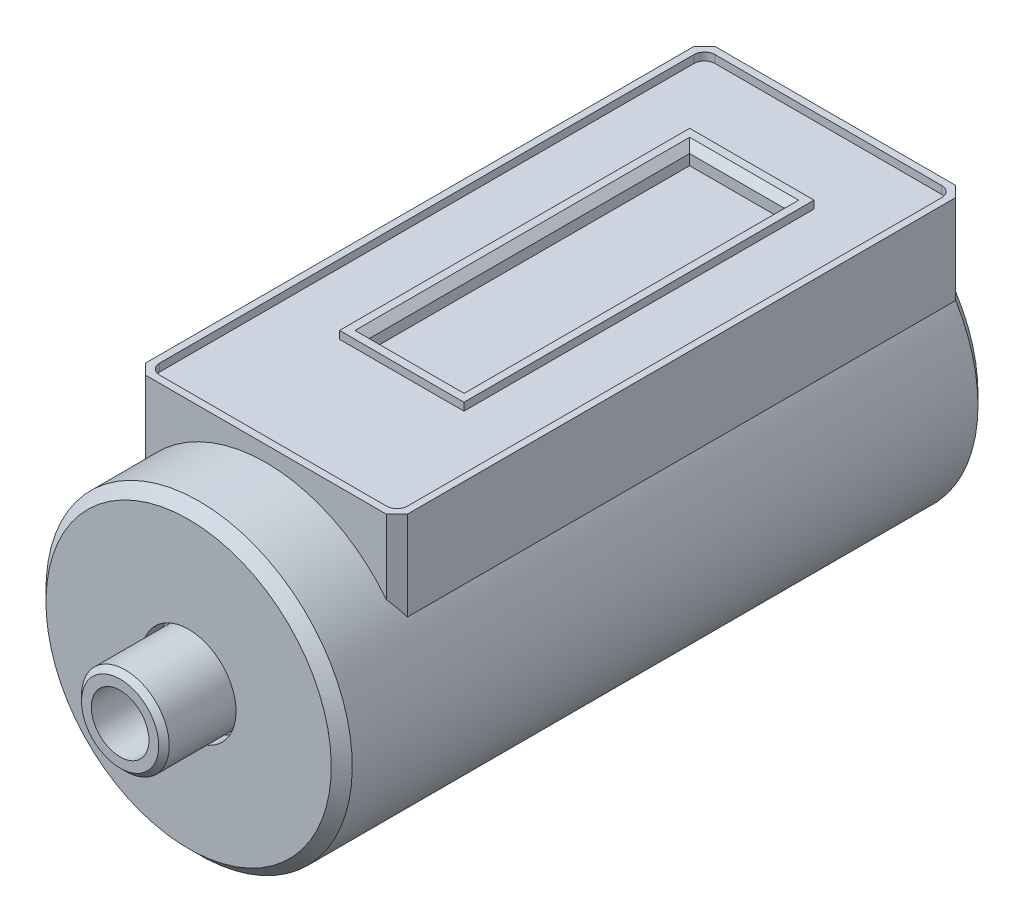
from build123d import *

# Parameters (mm, degrees)
EXTRUDE1_DEPTH     = 12.19
CHAMFER1_SIZE      = 0.76
SKETCH4_W          = 8.99
SKETCH4_H          = 25.3
CUT_EXTRUDE1_DEPTH = 0.56
SKETCH5_W          = 6.86
SKETCH5_H          = 23.16
CUT_EXTRUDE2_DEPTH = 1.27
CHAMFER2_SIZE      = 0.51
HOLE1_D            = 4.1656
HOLE1_DEPTH        = 6.35
HOLE1_TIP          = 1.251472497


with BuildPart() as part:
    # Sketch2 → Revolve1 (revolve)
    with BuildSketch(Plane(origin=(0, 0, 0), x_dir=(0, 0, -1), z_dir=(1, 0, 0))):
        Polygon((44.31, 0), (44.31, 2.79), (44.69, 3.17), (50.53, 3.17), (50.53, 3.43), (49.26, 3.43), (49.26, 10.31), (50.02, 11.07), (96, 11.07), (96, 0), align=None)
    revolve(axis=Axis((0, 0, -96), (0, 0, 1)))

    # Sketch3 → Extrude1 (add)
    with BuildSketch(Plane(origin=(0, 0, 0), x_dir=(1, 0, 0), z_dir=(0, 1, 0))):
        Polygon((-9.46, 96), (9.46, 96), (9.46, 55.61), (8.7, 54.85), (-8.7, 54.85), (-9.46, 55.61), align=None)
    extrude(amount=EXTRUDE1_DEPTH)

    # Chamfer1
    chamfer1_edges = [part.edges().sort_by_distance(p)[0] for p in [
        (0, -11.07, -96),
        (-9.46, 8.969599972, -96),
        (9.46, 8.969599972, -96),
    ]]
    chamfer(chamfer1_edges, length=CHAMFER1_SIZE)

    # Sketch4 → Cut-Extrude1 (cut)
    with BuildSketch(Plane(origin=(0, 12.19, 0), x_dir=(1, 0, 0), z_dir=(0, 1, 0))):
        with BuildLine():
            Line((-8.19, 95.49), (8.2, 95.49))
            ThreePointArc((8.2, 95.49), (8.737401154, 95.267401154), (8.96, 94.73))
            Line((8.96, 94.73), (8.96, 56.12))
            ThreePointArc((8.96, 56.12), (8.737401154, 55.582598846), (8.2, 55.36))
            Line((8.2, 55.36), (-8.19, 55.36))
            ThreePointArc((-8.19, 55.36), (-8.727401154, 55.582598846), (-8.95, 56.12))
            Line((-8.95, 56.12), (-8.95, 94.73))
            ThreePointArc((-8.95, 94.73), (-8.727401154, 95.267401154), (-8.19, 95.49))
        make_face()
        with Locations((0.005, 77.31)):
            Rectangle(SKETCH4_W, SKETCH4_H, mode=Mode.SUBTRACT)
    extrude(amount=-CUT_EXTRUDE1_DEPTH, mode=Mode.SUBTRACT)

    # Sketch5 → Cut-Extrude2 (cut)
    with BuildSketch(Plane(origin=(0, 12.19, 0), x_dir=(1, 0, 0), z_dir=(0, 1, 0))):
        with Locations((0.01, 77.31)):
            Rectangle(SKETCH5_W, SKETCH5_H)
    extrude(amount=-CUT_EXTRUDE2_DEPTH, mode=Mode.SUBTRACT)

    # Chamfer2
    chamfer2_edges = [part.edges().sort_by_distance(p)[0] for p in [
        (-3.42, 12.19, -77.31),
        (0.01, 12.19, -65.73),
        (3.44, 12.19, -77.31),
        (0.01, 12.19, -88.89),
    ]]
    chamfer(chamfer2_edges, length=CHAMFER2_SIZE)

    # Hole1
    with Locations(Plane.XY.offset(-44.31)):
        with Locations((0, 0)):
            Hole(HOLE1_D / 2, depth=HOLE1_DEPTH)
            with Locations((0, 0, -(HOLE1_DEPTH + HOLE1_TIP / 2))):  # 118° drill point
                Cone(0, HOLE1_D / 2, HOLE1_TIP, mode=Mode.SUBTRACT)


solid = part.part
